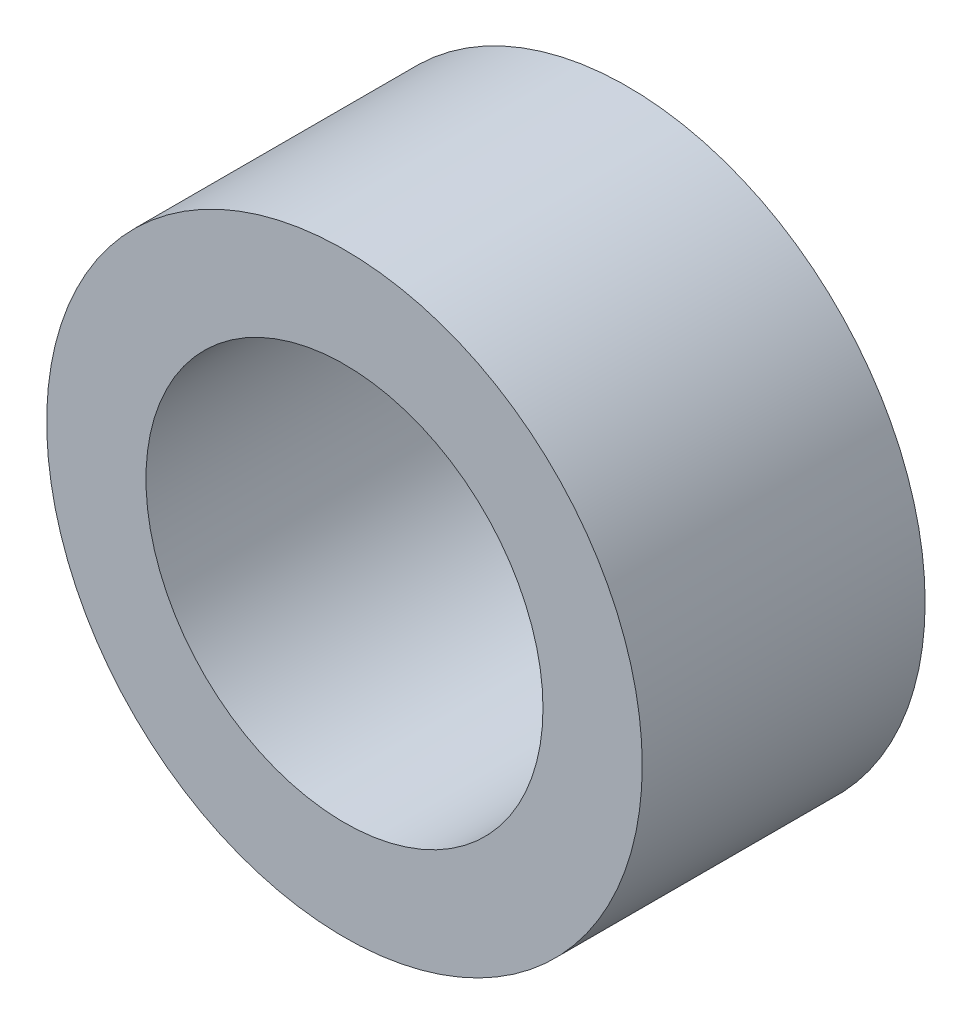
from build123d import *

# Parameters (mm, degrees)
SKETCH1_W = 1
SKETCH1_H = 2.85


with BuildPart() as part:
    # Sketch1 → Revolve1 (revolve)
    with BuildSketch(Plane(origin=(0, 0, 0), x_dir=(1, 0, 0), z_dir=(0, 1, 0))):
        with Locations((2.5, -1.425)):
            Rectangle(SKETCH1_W, SKETCH1_H)
    revolve(axis=Axis((0, 0, 0), (0, 0, 1)))


solid = part.part
